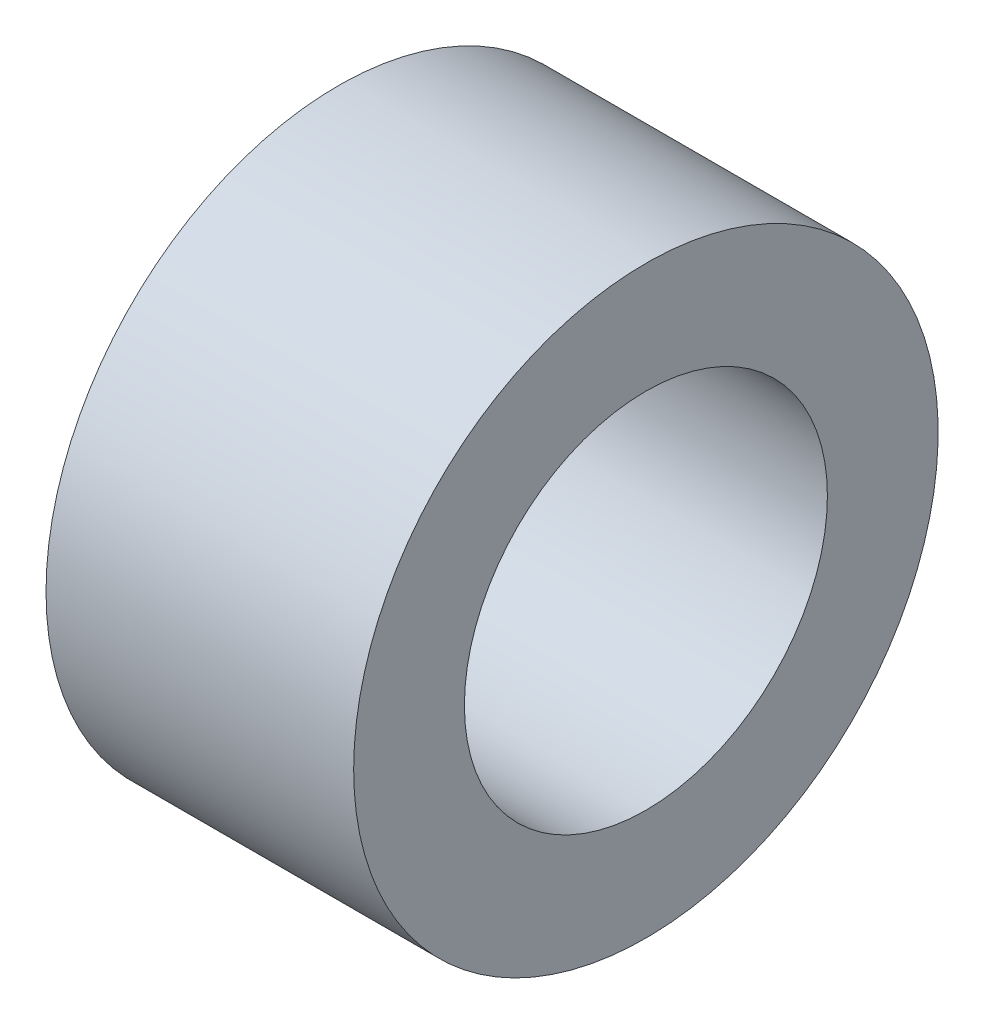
ISO-10303-21;
HEADER;
FILE_DESCRIPTION(('STEP AP214'),'2;1');
FILE_NAME('part.step','',(''),(''),'','','');
FILE_SCHEMA(('AUTOMOTIVE_DESIGN { 1 0 10303 214 1 1 1 1 }'));
ENDSEC;
DATA;
#1=APPLICATION_CONTEXT('core data for automotive mechanical design processes');
#2=APPLICATION_PROTOCOL_DEFINITION('international standard','automotive_design',2000,#1);
#3=PRODUCT_CONTEXT('',#1,'mechanical');
#4=PRODUCT('Part','Part','',(#3));
#5=PRODUCT_RELATED_PRODUCT_CATEGORY('part','',(#4));
#6=PRODUCT_DEFINITION_FORMATION('','',#4);
#7=PRODUCT_DEFINITION_CONTEXT('part definition',#1,'design');
#8=PRODUCT_DEFINITION('design','',#6,#7);
#9=PRODUCT_DEFINITION_SHAPE('','',#8);
#10=(LENGTH_UNIT() NAMED_UNIT(*) SI_UNIT(.MILLI.,.METRE.));
#11=(NAMED_UNIT(*) PLANE_ANGLE_UNIT() SI_UNIT($,.RADIAN.));
#12=(NAMED_UNIT(*) SI_UNIT($,.STERADIAN.) SOLID_ANGLE_UNIT());
#13=UNCERTAINTY_MEASURE_WITH_UNIT(LENGTH_MEASURE(1.E-05),#10,'distance_accuracy_value','');
#14=(GEOMETRIC_REPRESENTATION_CONTEXT(3) GLOBAL_UNCERTAINTY_ASSIGNED_CONTEXT((#13)) GLOBAL_UNIT_ASSIGNED_CONTEXT((#10,
#11,#12)) REPRESENTATION_CONTEXT('',''));
#15=CARTESIAN_POINT('',(0.,0.,0.));
#16=DIRECTION('',(0.,0.,1.));
#17=DIRECTION('',(1.,0.,0.));
#18=AXIS2_PLACEMENT_3D('',#15,#16,#17);
#19=CARTESIAN_POINT('',(0.,0.,0.));
#20=DIRECTION('',(-1.,0.,0.));
#21=DIRECTION('',(0.,0.,1.));
#22=AXIS2_PLACEMENT_3D('',#19,#20,#21);
#23=CYLINDRICAL_SURFACE('',#22,5.9);
#24=CARTESIAN_POINT('',(10.,0.,0.));
#25=DIRECTION('',(-1.,0.,0.));
#26=DIRECTION('',(0.,0.,1.));
#27=AXIS2_PLACEMENT_3D('',#24,#25,#26);
#28=CIRCLE('',#27,5.9);
#29=CARTESIAN_POINT('',(10.,0.,5.9));
#30=VERTEX_POINT('',#29);
#31=EDGE_CURVE('E43',#30,#30,#28,.T.);
#32=ORIENTED_EDGE('',*,*,#31,.F.);
#33=EDGE_LOOP('',(#32));
#34=FACE_BOUND('',#33,.T.);
#35=CARTESIAN_POINT('',(0.,0.,0.));
#36=DIRECTION('',(-1.,0.,0.));
#37=DIRECTION('',(0.,0.,1.));
#38=AXIS2_PLACEMENT_3D('',#35,#36,#37);
#39=CIRCLE('',#38,5.9);
#40=CARTESIAN_POINT('',(0.,0.,5.9));
#41=VERTEX_POINT('',#40);
#42=EDGE_CURVE('E10',#41,#41,#39,.T.);
#43=ORIENTED_EDGE('',*,*,#42,.T.);
#44=EDGE_LOOP('',(#43));
#45=FACE_BOUND('',#44,.T.);
#46=ADVANCED_FACE('F29',(#34,#45),#23,.F.);
#47=CARTESIAN_POINT('',(0.,5.9,0.));
#48=DIRECTION('',(1.,0.,0.));
#49=DIRECTION('',(0.,0.,-1.));
#50=AXIS2_PLACEMENT_3D('',#47,#48,#49);
#51=PLANE('',#50);
#52=ORIENTED_EDGE('',*,*,#42,.F.);
#53=EDGE_LOOP('',(#52));
#54=FACE_BOUND('',#53,.T.);
#55=CARTESIAN_POINT('',(0.,0.,0.));
#56=DIRECTION('',(-1.,0.,0.));
#57=DIRECTION('',(0.,0.,1.));
#58=AXIS2_PLACEMENT_3D('',#55,#56,#57);
#59=CIRCLE('',#58,9.5);
#60=CARTESIAN_POINT('',(0.,0.,9.5));
#61=VERTEX_POINT('',#60);
#62=EDGE_CURVE('E35',#61,#61,#59,.T.);
#63=ORIENTED_EDGE('',*,*,#62,.T.);
#64=EDGE_LOOP('',(#63));
#65=FACE_BOUND('',#64,.T.);
#66=ADVANCED_FACE('F52',(#54,#65),#51,.F.);
#67=CARTESIAN_POINT('',(0.,0.,0.));
#68=DIRECTION('',(-1.,0.,0.));
#69=DIRECTION('',(0.,0.,1.));
#70=AXIS2_PLACEMENT_3D('',#67,#68,#69);
#71=CYLINDRICAL_SURFACE('',#70,9.5);
#72=ORIENTED_EDGE('',*,*,#62,.F.);
#73=EDGE_LOOP('',(#72));
#74=FACE_BOUND('',#73,.T.);
#75=CARTESIAN_POINT('',(10.,0.,0.));
#76=DIRECTION('',(-1.,0.,0.));
#77=DIRECTION('',(0.,0.,1.));
#78=AXIS2_PLACEMENT_3D('',#75,#76,#77);
#79=CIRCLE('',#78,9.5);
#80=CARTESIAN_POINT('',(10.,0.,9.5));
#81=VERTEX_POINT('',#80);
#82=EDGE_CURVE('E39',#81,#81,#79,.T.);
#83=ORIENTED_EDGE('',*,*,#82,.T.);
#84=EDGE_LOOP('',(#83));
#85=FACE_BOUND('',#84,.T.);
#86=ADVANCED_FACE('F56',(#74,#85),#71,.T.);
#87=CARTESIAN_POINT('',(10.,9.5,0.));
#88=DIRECTION('',(-1.,0.,0.));
#89=DIRECTION('',(0.,0.,1.));
#90=AXIS2_PLACEMENT_3D('',#87,#88,#89);
#91=PLANE('',#90);
#92=ORIENTED_EDGE('',*,*,#82,.F.);
#93=EDGE_LOOP('',(#92));
#94=FACE_BOUND('',#93,.T.);
#95=ORIENTED_EDGE('',*,*,#31,.T.);
#96=EDGE_LOOP('',(#95));
#97=FACE_BOUND('',#96,.T.);
#98=ADVANCED_FACE('F49',(#94,#97),#91,.F.);
#99=CLOSED_SHELL('',(#46,#66,#86,#98));
#100=MANIFOLD_SOLID_BREP('B2',#99);
#101=ADVANCED_BREP_SHAPE_REPRESENTATION('',(#18,#100),#14);
#102=SHAPE_DEFINITION_REPRESENTATION(#9,#101);
ENDSEC;
END-ISO-10303-21;
